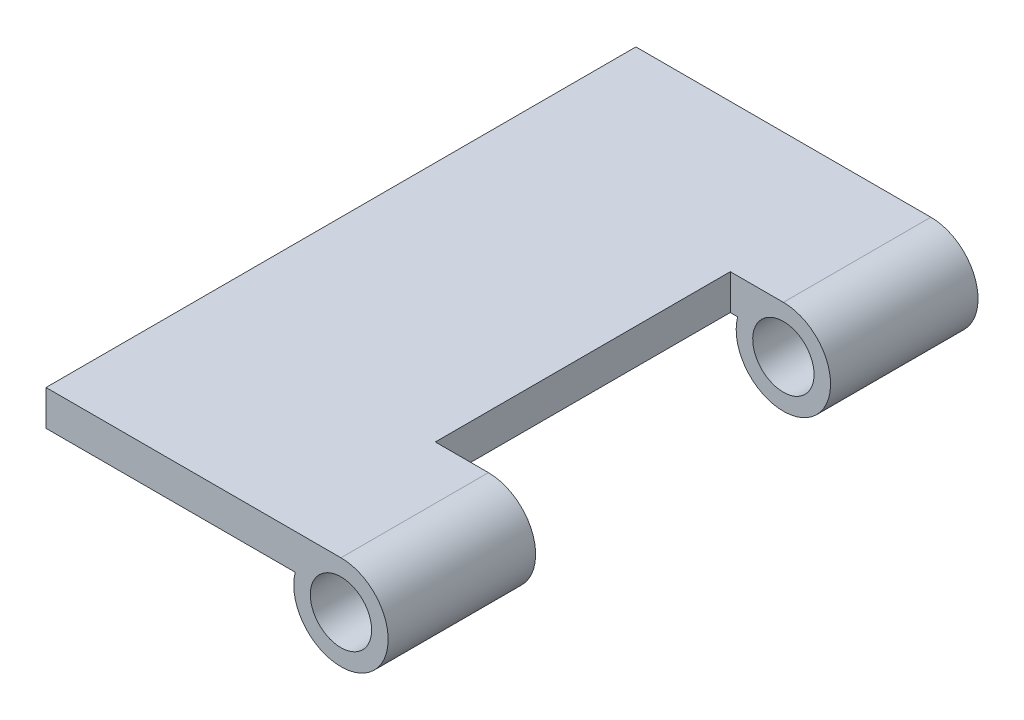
ISO-10303-21;
HEADER;
FILE_DESCRIPTION(('STEP AP214'),'2;1');
FILE_NAME('part.step','',(''),(''),'','','');
FILE_SCHEMA(('AUTOMOTIVE_DESIGN { 1 0 10303 214 1 1 1 1 }'));
ENDSEC;
DATA;
#1=APPLICATION_CONTEXT('core data for automotive mechanical design processes');
#2=APPLICATION_PROTOCOL_DEFINITION('international standard','automotive_design',2000,#1);
#3=PRODUCT_CONTEXT('',#1,'mechanical');
#4=PRODUCT('Part','Part','',(#3));
#5=PRODUCT_RELATED_PRODUCT_CATEGORY('part','',(#4));
#6=PRODUCT_DEFINITION_FORMATION('','',#4);
#7=PRODUCT_DEFINITION_CONTEXT('part definition',#1,'design');
#8=PRODUCT_DEFINITION('design','',#6,#7);
#9=PRODUCT_DEFINITION_SHAPE('','',#8);
#10=(LENGTH_UNIT() NAMED_UNIT(*) SI_UNIT(.MILLI.,.METRE.));
#11=(NAMED_UNIT(*) PLANE_ANGLE_UNIT() SI_UNIT($,.RADIAN.));
#12=(NAMED_UNIT(*) SI_UNIT($,.STERADIAN.) SOLID_ANGLE_UNIT());
#13=UNCERTAINTY_MEASURE_WITH_UNIT(LENGTH_MEASURE(1.E-05),#10,'distance_accuracy_value','');
#14=(GEOMETRIC_REPRESENTATION_CONTEXT(3) GLOBAL_UNCERTAINTY_ASSIGNED_CONTEXT((#13)) GLOBAL_UNIT_ASSIGNED_CONTEXT((#10,
#11,#12)) REPRESENTATION_CONTEXT('',''));
#15=CARTESIAN_POINT('',(0.,0.,0.));
#16=DIRECTION('',(0.,0.,1.));
#17=DIRECTION('',(1.,0.,0.));
#18=AXIS2_PLACEMENT_3D('',#15,#16,#17);
#19=CARTESIAN_POINT('',(0.,0.,50.));
#20=DIRECTION('',(0.,0.,-1.));
#21=DIRECTION('',(-1.,0.,0.));
#22=AXIS2_PLACEMENT_3D('',#19,#20,#21);
#23=CYLINDRICAL_SURFACE('',#22,4.);
#24=CARTESIAN_POINT('',(0.,0.,12.5));
#25=DIRECTION('',(0.,0.,-1.));
#26=DIRECTION('',(1.,0.,0.));
#27=AXIS2_PLACEMENT_3D('',#24,#25,#26);
#28=CIRCLE('',#27,4.);
#29=CARTESIAN_POINT('',(-3.87298334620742,1.,12.5));
#30=VERTEX_POINT('',#29);
#31=CARTESIAN_POINT('',(0.,4.,12.5));
#32=VERTEX_POINT('',#31);
#33=EDGE_CURVE('E101',#30,#32,#28,.F.);
#34=ORIENTED_EDGE('',*,*,#33,.F.);
#35=DIRECTION('',(0.,0.,-1.));
#36=VECTOR('',#35,1.);
#37=CARTESIAN_POINT('',(-3.87298334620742,1.,50.));
#38=LINE('',#37,#36);
#39=CARTESIAN_POINT('',(-3.87298334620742,1.,0.));
#40=VERTEX_POINT('',#39);
#41=EDGE_CURVE('E40',#30,#40,#38,.T.);
#42=ORIENTED_EDGE('',*,*,#41,.T.);
#43=CARTESIAN_POINT('',(0.,0.,0.));
#44=DIRECTION('',(0.,0.,1.));
#45=DIRECTION('',(-1.,0.,0.));
#46=AXIS2_PLACEMENT_3D('',#43,#44,#45);
#47=CIRCLE('',#46,4.);
#48=CARTESIAN_POINT('',(0.,4.,0.));
#49=VERTEX_POINT('',#48);
#50=EDGE_CURVE('E148',#40,#49,#47,.T.);
#51=ORIENTED_EDGE('',*,*,#50,.T.);
#52=DIRECTION('',(0.,0.,1.));
#53=VECTOR('',#52,1.);
#54=CARTESIAN_POINT('',(0.,4.,25.));
#55=LINE('',#54,#53);
#56=EDGE_CURVE('E166',#49,#32,#55,.T.);
#57=ORIENTED_EDGE('',*,*,#56,.T.);
#58=EDGE_LOOP('',(#34,#42,#51,#57));
#59=FACE_BOUND('',#58,.T.);
#60=ADVANCED_FACE('F15',(#59),#23,.T.);
#61=CARTESIAN_POINT('',(0.,0.,50.));
#62=DIRECTION('',(0.,0.,-1.));
#63=DIRECTION('',(0.,-1.,0.));
#64=AXIS2_PLACEMENT_3D('',#61,#62,#63);
#65=CYLINDRICAL_SURFACE('',#64,2.6);
#66=CARTESIAN_POINT('',(0.,0.,37.5));
#67=DIRECTION('',(0.,0.,1.));
#68=DIRECTION('',(-1.,0.,0.));
#69=AXIS2_PLACEMENT_3D('',#66,#67,#68);
#70=CIRCLE('',#69,2.6);
#71=CARTESIAN_POINT('',(-2.6,0.,37.5));
#72=VERTEX_POINT('',#71);
#73=EDGE_CURVE('E19',#72,#72,#70,.F.);
#74=ORIENTED_EDGE('',*,*,#73,.T.);
#75=EDGE_LOOP('',(#74));
#76=FACE_BOUND('',#75,.T.);
#77=CARTESIAN_POINT('',(0.,0.,50.));
#78=DIRECTION('',(0.,0.,-1.));
#79=DIRECTION('',(0.,-1.,0.));
#80=AXIS2_PLACEMENT_3D('',#77,#78,#79);
#81=CIRCLE('',#80,2.6);
#82=CARTESIAN_POINT('',(0.,-2.6,50.));
#83=VERTEX_POINT('',#82);
#84=EDGE_CURVE('E136',#83,#83,#81,.T.);
#85=ORIENTED_EDGE('',*,*,#84,.F.);
#86=EDGE_LOOP('',(#85));
#87=FACE_BOUND('',#86,.T.);
#88=ADVANCED_FACE('F202',(#76,#87),#65,.F.);
#89=CARTESIAN_POINT('',(-12.5,1.,25.));
#90=DIRECTION('',(0.,-1.,0.));
#91=DIRECTION('',(-1.,0.,0.));
#92=AXIS2_PLACEMENT_3D('',#89,#90,#91);
#93=PLANE('',#92);
#94=DIRECTION('',(-1.,0.,0.));
#95=VECTOR('',#94,1.);
#96=CARTESIAN_POINT('',(-12.5,1.,37.5));
#97=LINE('',#96,#95);
#98=CARTESIAN_POINT('',(-3.87298334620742,1.,37.5));
#99=VERTEX_POINT('',#98);
#100=CARTESIAN_POINT('',(-4.5,1.,37.5));
#101=VERTEX_POINT('',#100);
#102=EDGE_CURVE('E131',#99,#101,#97,.T.);
#103=ORIENTED_EDGE('',*,*,#102,.F.);
#104=CARTESIAN_POINT('',(-3.87298334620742,1.,50.));
#105=VERTEX_POINT('',#104);
#106=EDGE_CURVE('E33',#105,#99,#38,.T.);
#107=ORIENTED_EDGE('',*,*,#106,.F.);
#108=DIRECTION('',(1.,0.,0.));
#109=VECTOR('',#108,1.);
#110=CARTESIAN_POINT('',(-12.5,1.,50.));
#111=LINE('',#110,#109);
#112=CARTESIAN_POINT('',(-25.,1.,50.));
#113=VERTEX_POINT('',#112);
#114=EDGE_CURVE('E10',#113,#105,#111,.T.);
#115=ORIENTED_EDGE('',*,*,#114,.F.);
#116=DIRECTION('',(0.,0.,1.));
#117=VECTOR('',#116,1.);
#118=CARTESIAN_POINT('',(-25.,1.,25.));
#119=LINE('',#118,#117);
#120=CARTESIAN_POINT('',(-25.,1.,0.));
#121=VERTEX_POINT('',#120);
#122=EDGE_CURVE('E176',#121,#113,#119,.T.);
#123=ORIENTED_EDGE('',*,*,#122,.F.);
#124=DIRECTION('',(-1.,0.,0.));
#125=VECTOR('',#124,1.);
#126=CARTESIAN_POINT('',(-12.5,1.,0.));
#127=LINE('',#126,#125);
#128=EDGE_CURVE('E25',#40,#121,#127,.T.);
#129=ORIENTED_EDGE('',*,*,#128,.F.);
#130=ORIENTED_EDGE('',*,*,#41,.F.);
#131=DIRECTION('',(1.,0.,0.));
#132=VECTOR('',#131,1.);
#133=CARTESIAN_POINT('',(-12.5,1.,12.5));
#134=LINE('',#133,#132);
#135=CARTESIAN_POINT('',(-4.5,1.,12.5));
#136=VERTEX_POINT('',#135);
#137=EDGE_CURVE('E125',#136,#30,#134,.T.);
#138=ORIENTED_EDGE('',*,*,#137,.F.);
#139=DIRECTION('',(0.,0.,-1.));
#140=VECTOR('',#139,1.);
#141=CARTESIAN_POINT('',(-4.5,1.,25.));
#142=LINE('',#141,#140);
#143=EDGE_CURVE('E92',#101,#136,#142,.T.);
#144=ORIENTED_EDGE('',*,*,#143,.F.);
#145=EDGE_LOOP('',(#103,#107,#115,#123,#129,#130,#138,#144));
#146=FACE_BOUND('',#145,.T.);
#147=ADVANCED_FACE('F17',(#146),#93,.T.);
#148=CARTESIAN_POINT('',(-12.5,4.,50.));
#149=DIRECTION('',(0.,0.,1.));
#150=DIRECTION('',(0.,1.,0.));
#151=AXIS2_PLACEMENT_3D('',#148,#149,#150);
#152=PLANE('',#151);
#153=ORIENTED_EDGE('',*,*,#84,.T.);
#154=EDGE_LOOP('',(#153));
#155=FACE_BOUND('',#154,.T.);
#156=ORIENTED_EDGE('',*,*,#114,.T.);
#157=CARTESIAN_POINT('',(0.,0.,50.));
#158=DIRECTION('',(0.,0.,-1.));
#159=DIRECTION('',(-1.,0.,0.));
#160=AXIS2_PLACEMENT_3D('',#157,#158,#159);
#161=CIRCLE('',#160,4.);
#162=CARTESIAN_POINT('',(0.,4.,50.));
#163=VERTEX_POINT('',#162);
#164=EDGE_CURVE('E144',#163,#105,#161,.T.);
#165=ORIENTED_EDGE('',*,*,#164,.F.);
#166=DIRECTION('',(-1.,0.,0.));
#167=VECTOR('',#166,1.);
#168=CARTESIAN_POINT('',(-12.5,4.,50.));
#169=LINE('',#168,#167);
#170=CARTESIAN_POINT('',(-25.,4.,50.));
#171=VERTEX_POINT('',#170);
#172=EDGE_CURVE('E153',#163,#171,#169,.T.);
#173=ORIENTED_EDGE('',*,*,#172,.T.);
#174=DIRECTION('',(0.,-1.,0.));
#175=VECTOR('',#174,1.);
#176=CARTESIAN_POINT('',(-25.,4.,50.));
#177=LINE('',#176,#175);
#178=EDGE_CURVE('E162',#171,#113,#177,.T.);
#179=ORIENTED_EDGE('',*,*,#178,.T.);
#180=EDGE_LOOP('',(#156,#165,#173,#179));
#181=FACE_BOUND('',#180,.T.);
#182=ADVANCED_FACE('F281',(#155,#181),#152,.T.);
#183=CARTESIAN_POINT('',(-12.5,4.,0.));
#184=DIRECTION('',(0.,0.,-1.));
#185=DIRECTION('',(0.,-1.,0.));
#186=AXIS2_PLACEMENT_3D('',#183,#184,#185);
#187=PLANE('',#186);
#188=CARTESIAN_POINT('',(0.,0.,0.));
#189=DIRECTION('',(0.,0.,1.));
#190=DIRECTION('',(0.,-1.,0.));
#191=AXIS2_PLACEMENT_3D('',#188,#189,#190);
#192=CIRCLE('',#191,2.6);
#193=CARTESIAN_POINT('',(0.,-2.60000000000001,0.));
#194=VERTEX_POINT('',#193);
#195=EDGE_CURVE('E140',#194,#194,#192,.T.);
#196=ORIENTED_EDGE('',*,*,#195,.T.);
#197=EDGE_LOOP('',(#196));
#198=FACE_BOUND('',#197,.T.);
#199=DIRECTION('',(1.,0.,0.));
#200=VECTOR('',#199,1.);
#201=CARTESIAN_POINT('',(-12.5,4.,0.));
#202=LINE('',#201,#200);
#203=CARTESIAN_POINT('',(-25.,4.,0.));
#204=VERTEX_POINT('',#203);
#205=EDGE_CURVE('E163',#204,#49,#202,.T.);
#206=ORIENTED_EDGE('',*,*,#205,.T.);
#207=ORIENTED_EDGE('',*,*,#50,.F.);
#208=ORIENTED_EDGE('',*,*,#128,.T.);
#209=DIRECTION('',(0.,-1.,0.));
#210=VECTOR('',#209,1.);
#211=CARTESIAN_POINT('',(-25.,4.,0.));
#212=LINE('',#211,#210);
#213=EDGE_CURVE('E172',#204,#121,#212,.T.);
#214=ORIENTED_EDGE('',*,*,#213,.F.);
#215=EDGE_LOOP('',(#206,#207,#208,#214));
#216=FACE_BOUND('',#215,.T.);
#217=ADVANCED_FACE('F273',(#198,#216),#187,.T.);
#218=CARTESIAN_POINT('',(-12.5,4.,25.));
#219=DIRECTION('',(0.,1.,0.));
#220=DIRECTION('',(1.,0.,0.));
#221=AXIS2_PLACEMENT_3D('',#218,#219,#220);
#222=PLANE('',#221);
#223=DIRECTION('',(1.,0.,0.));
#224=VECTOR('',#223,1.);
#225=CARTESIAN_POINT('',(-4.5,4.,37.5));
#226=LINE('',#225,#224);
#227=CARTESIAN_POINT('',(-4.5,4.,37.5));
#228=VERTEX_POINT('',#227);
#229=CARTESIAN_POINT('',(0.,4.,37.5));
#230=VERTEX_POINT('',#229);
#231=EDGE_CURVE('E106',#228,#230,#226,.T.);
#232=ORIENTED_EDGE('',*,*,#231,.F.);
#233=DIRECTION('',(0.,0.,1.));
#234=VECTOR('',#233,1.);
#235=CARTESIAN_POINT('',(-4.5,4.,25.));
#236=LINE('',#235,#234);
#237=CARTESIAN_POINT('',(-4.5,4.,12.5));
#238=VERTEX_POINT('',#237);
#239=EDGE_CURVE('E89',#238,#228,#236,.T.);
#240=ORIENTED_EDGE('',*,*,#239,.F.);
#241=DIRECTION('',(1.,0.,0.));
#242=VECTOR('',#241,1.);
#243=CARTESIAN_POINT('',(-4.5,4.,12.5));
#244=LINE('',#243,#242);
#245=EDGE_CURVE('E96',#238,#32,#244,.T.);
#246=ORIENTED_EDGE('',*,*,#245,.T.);
#247=ORIENTED_EDGE('',*,*,#56,.F.);
#248=ORIENTED_EDGE('',*,*,#205,.F.);
#249=DIRECTION('',(0.,0.,-1.));
#250=VECTOR('',#249,1.);
#251=CARTESIAN_POINT('',(-25.,4.,25.));
#252=LINE('',#251,#250);
#253=EDGE_CURVE('E158',#171,#204,#252,.T.);
#254=ORIENTED_EDGE('',*,*,#253,.F.);
#255=ORIENTED_EDGE('',*,*,#172,.F.);
#256=EDGE_CURVE('E157',#230,#163,#55,.T.);
#257=ORIENTED_EDGE('',*,*,#256,.F.);
#258=EDGE_LOOP('',(#232,#240,#246,#247,#248,#254,#255,#257));
#259=FACE_BOUND('',#258,.T.);
#260=ADVANCED_FACE('F109',(#259),#222,.T.);
#261=CARTESIAN_POINT('',(-25.,4.,25.));
#262=DIRECTION('',(-1.,0.,0.));
#263=DIRECTION('',(0.,1.,0.));
#264=AXIS2_PLACEMENT_3D('',#261,#262,#263);
#265=PLANE('',#264);
#266=ORIENTED_EDGE('',*,*,#253,.T.);
#267=ORIENTED_EDGE('',*,*,#213,.T.);
#268=ORIENTED_EDGE('',*,*,#122,.T.);
#269=ORIENTED_EDGE('',*,*,#178,.F.);
#270=EDGE_LOOP('',(#266,#267,#268,#269));
#271=FACE_BOUND('',#270,.T.);
#272=ADVANCED_FACE('F212',(#271),#265,.T.);
#273=CARTESIAN_POINT('',(0.,0.,37.5));
#274=DIRECTION('',(0.,0.,1.));
#275=DIRECTION('',(-1.,0.,0.));
#276=AXIS2_PLACEMENT_3D('',#273,#274,#275);
#277=CIRCLE('',#276,4.);
#278=EDGE_CURVE('E128',#230,#99,#277,.F.);
#279=ORIENTED_EDGE('',*,*,#278,.F.);
#280=ORIENTED_EDGE('',*,*,#256,.T.);
#281=ORIENTED_EDGE('',*,*,#164,.T.);
#282=ORIENTED_EDGE('',*,*,#106,.T.);
#283=EDGE_LOOP('',(#279,#280,#281,#282));
#284=FACE_BOUND('',#283,.T.);
#285=ADVANCED_FACE('F204',(#284),#23,.T.);
#286=CARTESIAN_POINT('',(0.,0.,12.5));
#287=DIRECTION('',(0.,0.,-1.));
#288=DIRECTION('',(1.,0.,0.));
#289=AXIS2_PLACEMENT_3D('',#286,#287,#288);
#290=CIRCLE('',#289,2.6);
#291=CARTESIAN_POINT('',(2.6,0.,12.5));
#292=VERTEX_POINT('',#291);
#293=EDGE_CURVE('E122',#292,#292,#290,.F.);
#294=ORIENTED_EDGE('',*,*,#293,.T.);
#295=EDGE_LOOP('',(#294));
#296=FACE_BOUND('',#295,.T.);
#297=ORIENTED_EDGE('',*,*,#195,.F.);
#298=EDGE_LOOP('',(#297));
#299=FACE_BOUND('',#298,.T.);
#300=ADVANCED_FACE('F188',(#296,#299),#65,.F.);
#301=CARTESIAN_POINT('',(-4.5,0.,37.5));
#302=DIRECTION('',(0.,0.,1.));
#303=DIRECTION('',(-1.,0.,0.));
#304=AXIS2_PLACEMENT_3D('',#301,#302,#303);
#305=PLANE('',#304);
#306=ORIENTED_EDGE('',*,*,#102,.T.);
#307=DIRECTION('',(0.,-1.,0.));
#308=VECTOR('',#307,1.);
#309=CARTESIAN_POINT('',(-4.5,0.,37.5));
#310=LINE('',#309,#308);
#311=EDGE_CURVE('E113',#228,#101,#310,.T.);
#312=ORIENTED_EDGE('',*,*,#311,.F.);
#313=ORIENTED_EDGE('',*,*,#231,.T.);
#314=ORIENTED_EDGE('',*,*,#278,.T.);
#315=EDGE_LOOP('',(#306,#312,#313,#314));
#316=FACE_BOUND('',#315,.T.);
#317=ORIENTED_EDGE('',*,*,#73,.F.);
#318=EDGE_LOOP('',(#317));
#319=FACE_BOUND('',#318,.T.);
#320=ADVANCED_FACE('F191',(#316,#319),#305,.F.);
#321=CARTESIAN_POINT('',(-4.5,0.,12.5));
#322=DIRECTION('',(0.,0.,-1.));
#323=DIRECTION('',(1.,0.,0.));
#324=AXIS2_PLACEMENT_3D('',#321,#322,#323);
#325=PLANE('',#324);
#326=ORIENTED_EDGE('',*,*,#137,.T.);
#327=ORIENTED_EDGE('',*,*,#33,.T.);
#328=ORIENTED_EDGE('',*,*,#245,.F.);
#329=DIRECTION('',(0.,1.,0.));
#330=VECTOR('',#329,1.);
#331=CARTESIAN_POINT('',(-4.5,0.,12.5));
#332=LINE('',#331,#330);
#333=EDGE_CURVE('E84',#136,#238,#332,.T.);
#334=ORIENTED_EDGE('',*,*,#333,.F.);
#335=EDGE_LOOP('',(#326,#327,#328,#334));
#336=FACE_BOUND('',#335,.T.);
#337=ORIENTED_EDGE('',*,*,#293,.F.);
#338=EDGE_LOOP('',(#337));
#339=FACE_BOUND('',#338,.T.);
#340=ADVANCED_FACE('F99',(#336,#339),#325,.F.);
#341=CARTESIAN_POINT('',(-4.5,0.,25.));
#342=DIRECTION('',(-1.,0.,0.));
#343=DIRECTION('',(0.,1.,0.));
#344=AXIS2_PLACEMENT_3D('',#341,#342,#343);
#345=PLANE('',#344);
#346=ORIENTED_EDGE('',*,*,#143,.T.);
#347=ORIENTED_EDGE('',*,*,#333,.T.);
#348=ORIENTED_EDGE('',*,*,#239,.T.);
#349=ORIENTED_EDGE('',*,*,#311,.T.);
#350=EDGE_LOOP('',(#346,#347,#348,#349));
#351=FACE_BOUND('',#350,.T.);
#352=ADVANCED_FACE('F86',(#351),#345,.F.);
#353=CLOSED_SHELL('',(#60,#88,#147,#182,#217,#260,#272,#285,#300,#320,#340,#352));
#354=MANIFOLD_SOLID_BREP('B1',#353);
#355=ADVANCED_BREP_SHAPE_REPRESENTATION('',(#18,#354),#14);
#356=SHAPE_DEFINITION_REPRESENTATION(#9,#355);
ENDSEC;
END-ISO-10303-21;
